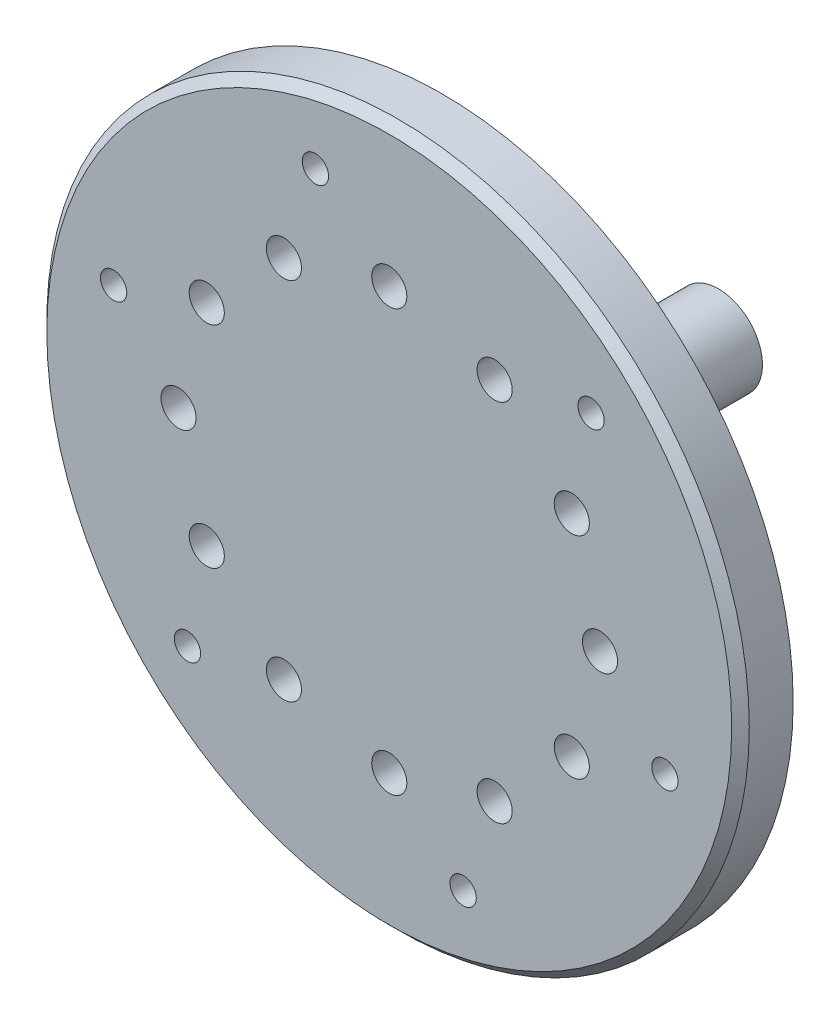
from build123d import *

# Parameters (mm, degrees)
ESQUISSE1_R                  = 80
BASE_EXTRUSION_DEPTH         = 12
CHANFREIN1_SIZE              = 2
ESQUISSE2_R                  = 12.5
BOSS_EXTRU_1_DEPTH           = 10
ESQUISSE3_R                  = 4
ENL_V_MAT_EXTRU_1_DEPTH      = 116.256236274
R_P_TITION_CIRCULAIRE1_COUNT = 12
ESQUISSE5_R                  = 3
ENL_V_MAT_EXTRU_2_DEPTH      = 116.256236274
R_P_TITION_CIRCULAIRE2_COUNT = 6
ESQUISSE6_R                  = 10
BOSS_EXTRU_2_DEPTH           = 53


with BuildPart() as part:
    # Esquisse1 → Base-Extrusion (new body)
    with BuildSketch(Plane.XY):
        Circle(ESQUISSE1_R)
    extrude(amount=BASE_EXTRUSION_DEPTH)

    # Chanfrein1
    chanfrein1_edges = [part.edges().sort_by_distance(p)[0] for p in [
        (-80, 0, 12),
    ]]
    chamfer(chanfrein1_edges, length=CHANFREIN1_SIZE)

    # Esquisse2 → Boss.-Extru.1 (add)
    with BuildSketch(Plane(origin=(0, 0, 0), x_dir=(-1, 0, 0), z_dir=(0, 0, -1))):
        with Locations(Location((0, 0, 0), (0, 0, 180))):
            Circle(ESQUISSE2_R)
    extrude(amount=BOSS_EXTRU_1_DEPTH)

    # Esquisse3 → Enl_v. mat.-Extru.1 (cut, through all)
    with BuildSketch(Plane.XY.offset(12)):
        with Locations((-48, 0)):
            Circle(ESQUISSE3_R)
    enl_v_mat_extru_1 = extrude(amount=-ENL_V_MAT_EXTRU_1_DEPTH, mode=Mode.SUBTRACT)

    # R_p_tition circulaire1: Enl_v. mat.-Extru.1 ×12 about axis
    r_p_tition_circulaire1_axis = Axis((0, 0, 0), (0, 0, -1))
    for i in range(1, R_P_TITION_CIRCULAIRE1_COUNT):
        add(enl_v_mat_extru_1.rotate(r_p_tition_circulaire1_axis, i * 360 / R_P_TITION_CIRCULAIRE1_COUNT), mode=Mode.SUBTRACT)

    # Esquisse5 → Enl_v. mat.-Extru.2 (cut, through all)
    with BuildSketch(Plane.XY.offset(12)):
        with Locations((-62.785178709, 16.823237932)):
            Circle(ESQUISSE5_R)
    enl_v_mat_extru_2 = extrude(amount=-ENL_V_MAT_EXTRU_2_DEPTH, mode=Mode.SUBTRACT)

    # R_p_tition circulaire2: Enl_v. mat.-Extru.2 ×6 about axis
    r_p_tition_circulaire2_axis = Axis((0, 0, 0), (0, 0, -1))
    for i in range(1, R_P_TITION_CIRCULAIRE2_COUNT):
        add(enl_v_mat_extru_2.rotate(r_p_tition_circulaire2_axis, i * 360 / R_P_TITION_CIRCULAIRE2_COUNT), mode=Mode.SUBTRACT)

    # Esquisse6 → Boss.-Extru.2 (add)
    with BuildSketch(Plane(origin=(0, 0, -10), x_dir=(-1, 0, 0), z_dir=(0, 0, -1))):
        Circle(ESQUISSE6_R)
    extrude(amount=BOSS_EXTRU_2_DEPTH)


solid = part.part
